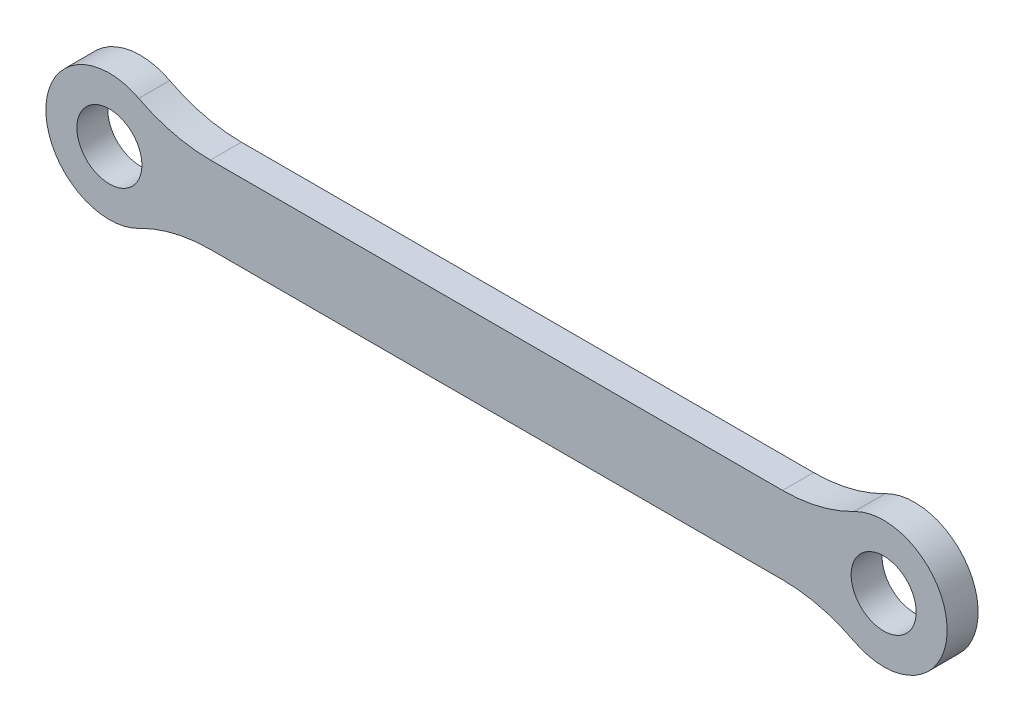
from build123d import *

# Parameters (mm, degrees)
ESQUISSE1_R        = 2.1
BOSS_EXTRU_1_DEPTH = 1
CONG_1_R           = 10


with BuildPart() as part:
    # Esquisse1 → Boss.-Extru.1 (new, symmetric)
    with BuildSketch(Plane.XY):
        with BuildLine():
            Line((-21.750384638, 2.5), (21.750384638, 2.5))
            ThreePointArc((21.750384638, 2.5), (29.1, 0), (21.750384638, -2.5))
            Line((21.750384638, -2.5), (-21.750384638, -2.5))
            ThreePointArc((-21.750384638, -2.5), (-29.1, 0), (-21.750384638, 2.5))
        make_face()
        with Locations((25, 0)):
            Circle(ESQUISSE1_R, mode=Mode.SUBTRACT)
        with Locations(Location((-25, 0, 0), (0, 0, 180))):
            Circle(ESQUISSE1_R, mode=Mode.SUBTRACT)
    extrude(amount=BOSS_EXTRU_1_DEPTH, both=True)

    # Cong_1
    cong_1_edges = [part.edges().sort_by_distance(p)[0] for p in [
        (-21.750384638, 2.5, 0),
        (21.750384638, 2.5, 0),
        (21.750384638, -2.5, 0),
        (-21.750384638, -2.5, 0),
    ]]
    fillet(cong_1_edges, radius=CONG_1_R)


solid = part.part
